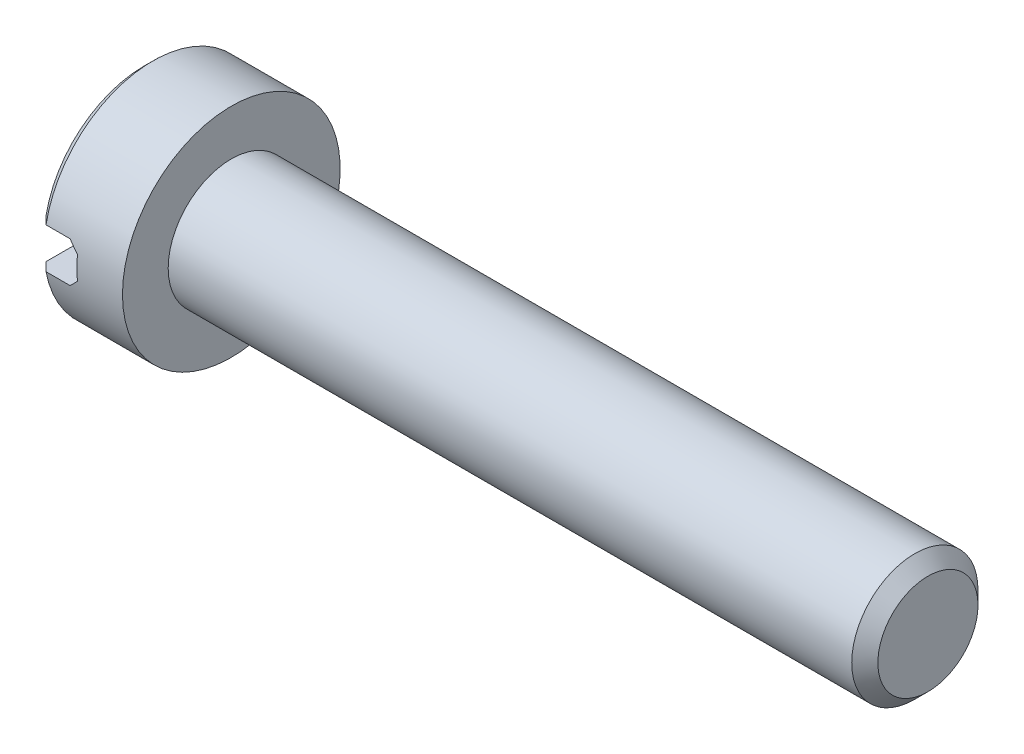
ISO-10303-21;
HEADER;
FILE_DESCRIPTION(('STEP AP214'),'2;1');
FILE_NAME('part.step','',(''),(''),'','','');
FILE_SCHEMA(('AUTOMOTIVE_DESIGN { 1 0 10303 214 1 1 1 1 }'));
ENDSEC;
DATA;
#1=APPLICATION_CONTEXT('core data for automotive mechanical design processes');
#2=APPLICATION_PROTOCOL_DEFINITION('international standard','automotive_design',2000,#1);
#3=PRODUCT_CONTEXT('',#1,'mechanical');
#4=PRODUCT('Part','Part','',(#3));
#5=PRODUCT_RELATED_PRODUCT_CATEGORY('part','',(#4));
#6=PRODUCT_DEFINITION_FORMATION('','',#4);
#7=PRODUCT_DEFINITION_CONTEXT('part definition',#1,'design');
#8=PRODUCT_DEFINITION('design','',#6,#7);
#9=PRODUCT_DEFINITION_SHAPE('','',#8);
#10=(LENGTH_UNIT() NAMED_UNIT(*) SI_UNIT(.MILLI.,.METRE.));
#11=(NAMED_UNIT(*) PLANE_ANGLE_UNIT() SI_UNIT($,.RADIAN.));
#12=(NAMED_UNIT(*) SI_UNIT($,.STERADIAN.) SOLID_ANGLE_UNIT());
#13=UNCERTAINTY_MEASURE_WITH_UNIT(LENGTH_MEASURE(1.E-05),#10,'distance_accuracy_value','');
#14=(GEOMETRIC_REPRESENTATION_CONTEXT(3) GLOBAL_UNCERTAINTY_ASSIGNED_CONTEXT((#13)) GLOBAL_UNIT_ASSIGNED_CONTEXT((#10,
#11,#12)) REPRESENTATION_CONTEXT('',''));
#15=CARTESIAN_POINT('',(0.,0.,0.));
#16=DIRECTION('',(0.,0.,1.));
#17=DIRECTION('',(1.,0.,0.));
#18=AXIS2_PLACEMENT_3D('',#15,#16,#17);
#19=CARTESIAN_POINT('',(2.,2.5,0.));
#20=DIRECTION('',(-1.,0.,0.));
#21=DIRECTION('',(0.,0.,1.));
#22=AXIS2_PLACEMENT_3D('',#19,#20,#21);
#23=PLANE('',#22);
#24=CARTESIAN_POINT('',(2.,0.,0.));
#25=DIRECTION('',(-1.,0.,0.));
#26=DIRECTION('',(0.,0.,1.));
#27=AXIS2_PLACEMENT_3D('',#24,#25,#26);
#28=CIRCLE('',#27,2.5);
#29=CARTESIAN_POINT('',(2.,0.,2.5));
#30=VERTEX_POINT('',#29);
#31=EDGE_CURVE('E198',#30,#30,#28,.T.);
#32=ORIENTED_EDGE('',*,*,#31,.F.);
#33=EDGE_LOOP('',(#32));
#34=FACE_BOUND('',#33,.T.);
#35=CARTESIAN_POINT('',(2.,0.,0.));
#36=DIRECTION('',(-1.,0.,0.));
#37=DIRECTION('',(0.,0.,1.));
#38=AXIS2_PLACEMENT_3D('',#35,#36,#37);
#39=CIRCLE('',#38,1.45);
#40=CARTESIAN_POINT('',(2.,0.,1.45));
#41=VERTEX_POINT('',#40);
#42=EDGE_CURVE('E150',#41,#41,#39,.F.);
#43=ORIENTED_EDGE('',*,*,#42,.F.);
#44=EDGE_LOOP('',(#43));
#45=FACE_BOUND('',#44,.T.);
#46=ADVANCED_FACE('F37',(#34,#45),#23,.F.);
#47=CARTESIAN_POINT('',(0.,0.,0.));
#48=DIRECTION('',(1.,0.,0.));
#49=DIRECTION('',(0.,0.,-1.));
#50=AXIS2_PLACEMENT_3D('',#47,#48,#49);
#51=PLANE('',#50);
#52=CARTESIAN_POINT('',(0.,0.,0.));
#53=DIRECTION('',(-1.,0.,0.));
#54=DIRECTION('',(0.,0.,1.));
#55=AXIS2_PLACEMENT_3D('',#52,#53,#54);
#56=CIRCLE('',#55,2.3);
#57=CARTESIAN_POINT('',(0.,0.465549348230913,2.25239068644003));
#58=VERTEX_POINT('',#57);
#59=CARTESIAN_POINT('',(0.,0.465549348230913,-2.25239068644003));
#60=VERTEX_POINT('',#59);
#61=EDGE_CURVE('E120',#58,#60,#56,.T.);
#62=ORIENTED_EDGE('',*,*,#61,.T.);
#63=DIRECTION('',(0.,0.,1.));
#64=VECTOR('',#63,1.);
#65=CARTESIAN_POINT('',(0.,0.465549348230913,-5.));
#66=LINE('',#65,#64);
#67=EDGE_CURVE('E112',#60,#58,#66,.T.);
#68=ORIENTED_EDGE('',*,*,#67,.T.);
#69=EDGE_LOOP('',(#62,#68));
#70=FACE_BOUND('',#69,.T.);
#71=ADVANCED_FACE('F166',(#70),#51,.F.);
#72=CARTESIAN_POINT('',(0.2,0.,0.));
#73=DIRECTION('',(1.,0.,0.));
#74=DIRECTION('',(0.,0.,-1.));
#75=AXIS2_PLACEMENT_3D('',#72,#73,#74);
#76=CONICAL_SURFACE('',#75,2.5,0.785398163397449);
#77=CARTESIAN_POINT('',(0.2,0.,0.));
#78=DIRECTION('',(-1.,0.,0.));
#79=DIRECTION('',(0.,0.,1.));
#80=AXIS2_PLACEMENT_3D('',#77,#78,#79);
#81=CIRCLE('',#80,2.5);
#82=CARTESIAN_POINT('',(0.2,0.465549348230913,2.45627030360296));
#83=VERTEX_POINT('',#82);
#84=CARTESIAN_POINT('',(0.2,0.465549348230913,-2.45627030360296));
#85=VERTEX_POINT('',#84);
#86=EDGE_CURVE('E121',#83,#85,#81,.T.);
#87=ORIENTED_EDGE('',*,*,#86,.T.);
#88=CARTESIAN_POINT('',(3.20259904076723,0.465549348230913,-5.48286968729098));
#89=CARTESIAN_POINT('',(3.00738145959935,0.465549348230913,-5.28694329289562));
#90=CARTESIAN_POINT('',(2.81219546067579,0.465549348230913,-5.09098538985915));
#91=CARTESIAN_POINT('',(2.42191937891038,0.465549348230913,-4.69895178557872));
#92=CARTESIAN_POINT('',(2.22682930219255,0.465549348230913,-4.50287607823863));
#93=CARTESIAN_POINT('',(1.83653240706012,0.465549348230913,-4.11030517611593));
#94=CARTESIAN_POINT('',(1.64132579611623,0.465549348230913,-3.9138097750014));
#95=CARTESIAN_POINT('',(1.25115924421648,0.465549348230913,-3.52059587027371));
#96=CARTESIAN_POINT('',(1.05619929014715,0.465549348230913,-3.32387737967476));
#97=CARTESIAN_POINT('',(0.678173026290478,0.465549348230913,-2.9416895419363));
#98=CARTESIAN_POINT('',(0.495084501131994,0.465549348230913,-2.7562421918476));
#99=CARTESIAN_POINT('',(0.220902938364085,0.465549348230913,-2.47759625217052));
#100=CARTESIAN_POINT('',(0.129576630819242,0.465549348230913,-2.38462728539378));
#101=CARTESIAN_POINT('',(-0.0528521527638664,0.465549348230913,-2.19847287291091));
#102=CARTESIAN_POINT('',(-0.143954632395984,0.465549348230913,-2.10528743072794));
#103=CARTESIAN_POINT('',(-0.325762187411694,0.465549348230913,-1.91867757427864));
#104=CARTESIAN_POINT('',(-0.416467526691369,0.465549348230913,-1.82525341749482));
#105=CARTESIAN_POINT('',(-0.597381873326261,0.465549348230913,-1.63791440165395));
#106=CARTESIAN_POINT('',(-0.687590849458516,0.465549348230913,-1.54399951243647));
#107=CARTESIAN_POINT('',(-0.867162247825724,0.465549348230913,-1.3554114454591));
#108=CARTESIAN_POINT('',(-0.956524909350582,0.465549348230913,-1.26073849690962));
#109=CARTESIAN_POINT('',(-1.08939468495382,0.465549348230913,-1.11764625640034));
#110=CARTESIAN_POINT('',(-1.1334867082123,0.465549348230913,-1.06977082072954));
#111=CARTESIAN_POINT('',(-1.2210969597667,0.465549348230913,-0.973498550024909));
#112=CARTESIAN_POINT('',(-1.26461520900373,0.465549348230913,-0.925101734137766));
#113=CARTESIAN_POINT('',(-1.3317610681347,0.465549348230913,-0.849065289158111));
#114=CARTESIAN_POINT('',(-1.35569012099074,0.465549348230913,-0.821692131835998));
#115=CARTESIAN_POINT('',(-1.40319102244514,0.465549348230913,-0.766632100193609));
#116=CARTESIAN_POINT('',(-1.42676283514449,0.465549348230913,-0.73894519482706));
#117=CARTESIAN_POINT('',(-1.47366376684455,0.465549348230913,-0.682886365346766));
#118=CARTESIAN_POINT('',(-1.49698800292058,0.465549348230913,-0.654510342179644));
#119=CARTESIAN_POINT('',(-1.54295549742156,0.465549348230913,-0.597221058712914));
#120=CARTESIAN_POINT('',(-1.56559892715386,0.465549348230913,-0.568307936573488));
#121=CARTESIAN_POINT('',(-1.61016736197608,0.465549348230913,-0.509419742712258));
#122=CARTESIAN_POINT('',(-1.63208156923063,0.465549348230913,-0.479436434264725));
#123=CARTESIAN_POINT('',(-1.67445976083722,0.465549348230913,-0.418389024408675));
#124=CARTESIAN_POINT('',(-1.69492180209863,0.465549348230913,-0.387323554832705));
#125=CARTESIAN_POINT('',(-1.73332185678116,0.465549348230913,-0.324061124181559));
#126=CARTESIAN_POINT('',(-1.75128287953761,0.465549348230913,-0.291878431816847));
#127=CARTESIAN_POINT('',(-1.78342369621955,0.465549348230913,-0.225717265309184));
#128=CARTESIAN_POINT('',(-1.79761500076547,0.465549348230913,-0.191744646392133));
#129=CARTESIAN_POINT('',(-1.81895609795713,0.465549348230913,-0.124795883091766));
#130=CARTESIAN_POINT('',(-1.8266128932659,0.465549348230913,-0.0919921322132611));
#131=CARTESIAN_POINT('',(-1.83488894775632,0.465549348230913,-0.0256267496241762));
#132=CARTESIAN_POINT('',(-1.83554895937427,0.465549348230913,0.00792935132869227));
#133=CARTESIAN_POINT('',(-1.82973306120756,0.465549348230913,0.0742464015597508));
#134=CARTESIAN_POINT('',(-1.82328333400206,0.465549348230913,0.107009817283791));
#135=CARTESIAN_POINT('',(-1.80956338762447,0.465549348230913,0.155027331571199));
#136=CARTESIAN_POINT('',(-1.80428518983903,0.465549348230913,0.170909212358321));
#137=CARTESIAN_POINT('',(-1.79261948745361,0.465549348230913,0.202260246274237));
#138=CARTESIAN_POINT('',(-1.78623214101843,0.465549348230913,0.217729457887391));
#139=CARTESIAN_POINT('',(-1.76761840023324,0.465549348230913,0.259328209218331));
#140=CARTESIAN_POINT('',(-1.7545143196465,0.465549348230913,0.285061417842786));
#141=CARTESIAN_POINT('',(-1.72651469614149,0.465549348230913,0.335544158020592));
#142=CARTESIAN_POINT('',(-1.71161720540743,0.465549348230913,0.360292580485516));
#143=CARTESIAN_POINT('',(-1.68054228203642,0.465549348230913,0.409079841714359));
#144=CARTESIAN_POINT('',(-1.66436078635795,0.465549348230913,0.433116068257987));
#145=CARTESIAN_POINT('',(-1.63111775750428,0.465549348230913,0.480575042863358));
#146=CARTESIAN_POINT('',(-1.61405601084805,0.465549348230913,0.503997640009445));
#147=CARTESIAN_POINT('',(-1.5616167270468,0.465549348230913,0.573971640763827));
#148=CARTESIAN_POINT('',(-1.52527399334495,0.465549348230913,0.619796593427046));
#149=CARTESIAN_POINT('',(-1.45124163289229,0.465549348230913,0.710149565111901));
#150=CARTESIAN_POINT('',(-1.41355526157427,0.465549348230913,0.7546802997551));
#151=CARTESIAN_POINT('',(-1.33810033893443,0.465549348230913,0.842013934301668));
#152=CARTESIAN_POINT('',(-1.30035092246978,0.465549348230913,0.884833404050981));
#153=CARTESIAN_POINT('',(-1.22427339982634,0.465549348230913,0.969954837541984));
#154=CARTESIAN_POINT('',(-1.18594527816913,0.465549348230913,1.01225678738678));
#155=CARTESIAN_POINT('',(-1.07035214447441,0.465549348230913,1.13862723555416));
#156=CARTESIAN_POINT('',(-0.992489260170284,0.465549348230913,1.22214795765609));
#157=CARTESIAN_POINT('',(-0.835814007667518,0.465549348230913,1.38847609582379));
#158=CARTESIAN_POINT('',(-0.757000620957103,0.465549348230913,1.47128254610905));
#159=CARTESIAN_POINT('',(-0.598849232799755,0.465549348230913,1.63637982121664));
#160=CARTESIAN_POINT('',(-0.519511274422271,0.465549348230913,1.71867068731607));
#161=CARTESIAN_POINT('',(-0.361217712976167,0.465549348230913,1.88216701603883));
#162=CARTESIAN_POINT('',(-0.282265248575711,0.465549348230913,1.9633755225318));
#163=CARTESIAN_POINT('',(-0.124123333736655,0.465549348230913,2.12556467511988));
#164=CARTESIAN_POINT('',(-0.044933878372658,0.465549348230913,2.20654531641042));
#165=CARTESIAN_POINT('',(0.192811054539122,0.465549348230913,2.44916767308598));
#166=CARTESIAN_POINT('',(0.351615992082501,0.465549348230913,2.61056482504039));
#167=CARTESIAN_POINT('',(0.732972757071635,0.465549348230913,2.99726131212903));
#168=CARTESIAN_POINT('',(0.955700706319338,0.465549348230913,3.22238674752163));
#169=CARTESIAN_POINT('',(1.401572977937,0.465549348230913,3.67230050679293));
#170=CARTESIAN_POINT('',(1.62471736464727,0.465549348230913,3.89708876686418));
#171=CARTESIAN_POINT('',(2.07358635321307,0.465549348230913,4.34881324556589));
#172=CARTESIAN_POINT('',(2.29931333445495,0.465549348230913,4.57574709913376));
#173=CARTESIAN_POINT('',(2.7508805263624,0.465549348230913,5.02942321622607));
#174=CARTESIAN_POINT('',(2.97672071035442,0.465549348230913,5.2561655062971));
#175=CARTESIAN_POINT('',(3.20259904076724,0.465549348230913,5.48286968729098));
#176=B_SPLINE_CURVE_WITH_KNOTS('',3,(#88,#89,#90,#91,#92,#93,#94,#95,#96,#97,#98,#99,#100,#101,
#102,#103,#104,#105,#106,#107,#108,#109,#110,#111,#112,#113,#114,#115,#116,#117,#118,#119,#120,
#121,#122,#123,#124,#125,#126,#127,#128,#129,#130,#131,#132,#133,#134,#135,#136,#137,#138,#139,
#140,#141,#142,#143,#144,#145,#146,#147,#148,#149,#150,#151,#152,#153,#154,#155,#156,#157,#158,
#159,#160,#161,#162,#163,#164,#165,#166,#167,#168,#169,#170,#171,#172,#173,#174,#175),
.UNSPECIFIED.,.F.,.F.,(4,2,2,2,2,2,2,2,2,2,2,2,2,2,2,2,2,2,2,2,2,2,2,2,2,2,2,2,2,2,2,2,2,2,2,2,
2,2,2,2,2,2,2,4),(0.,0.829743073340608,1.65953360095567,2.49046340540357,3.3213470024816,
4.10314469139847,4.49410926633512,4.88506752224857,5.27570632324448,5.66636942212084,
6.05691855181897,6.25217337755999,6.44742105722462,6.55649218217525,6.66557419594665,
6.77576205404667,6.88592195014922,6.99730763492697,7.10883965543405,7.21926609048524,
7.32935136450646,7.42981570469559,7.52969457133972,7.62920684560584,7.67938417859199,
7.72955436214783,7.81607261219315,7.90268569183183,7.9895847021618,8.07650488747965,
8.25190336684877,8.42690244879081,8.59814445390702,8.76939104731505,9.11193368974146,
9.45488345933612,9.79780541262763,10.1375912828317,10.4773842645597,11.1566564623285,
12.1067097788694,13.0569245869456,14.0171665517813,14.9772407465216),.UNSPECIFIED.);
#177=EDGE_CURVE('E60',#85,#60,#176,.T.);
#178=ORIENTED_EDGE('',*,*,#177,.T.);
#179=ORIENTED_EDGE('',*,*,#61,.F.);
#180=EDGE_CURVE('E192',#58,#83,#176,.T.);
#181=ORIENTED_EDGE('',*,*,#180,.T.);
#182=EDGE_LOOP('',(#87,#178,#179,#181));
#183=FACE_BOUND('',#182,.T.);
#184=ADVANCED_FACE('F172',(#183),#76,.T.);
#185=CARTESIAN_POINT('',(0.,-0.465549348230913,-2.25239068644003));
#186=VERTEX_POINT('',#185);
#187=CARTESIAN_POINT('',(0.,-0.465549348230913,2.25239068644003));
#188=VERTEX_POINT('',#187);
#189=EDGE_CURVE('E117',#186,#188,#56,.T.);
#190=ORIENTED_EDGE('',*,*,#189,.T.);
#191=DIRECTION('',(0.,0.,1.));
#192=VECTOR('',#191,1.);
#193=CARTESIAN_POINT('',(0.,-0.465549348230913,-5.));
#194=LINE('',#193,#192);
#195=EDGE_CURVE('E103',#186,#188,#194,.T.);
#196=ORIENTED_EDGE('',*,*,#195,.F.);
#197=EDGE_LOOP('',(#190,#196));
#198=FACE_BOUND('',#197,.T.);
#199=ADVANCED_FACE('F116',(#198),#51,.F.);
#200=CARTESIAN_POINT('',(0.2,-0.465549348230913,-2.45627030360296));
#201=VERTEX_POINT('',#200);
#202=CARTESIAN_POINT('',(0.2,-0.465549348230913,2.45627030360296));
#203=VERTEX_POINT('',#202);
#204=EDGE_CURVE('E125',#201,#203,#81,.T.);
#205=ORIENTED_EDGE('',*,*,#204,.T.);
#206=CARTESIAN_POINT('',(3.20259904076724,-0.465549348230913,5.48286968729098));
#207=CARTESIAN_POINT('',(3.00738145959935,-0.465549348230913,5.28694329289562));
#208=CARTESIAN_POINT('',(2.81219546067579,-0.465549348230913,5.09098538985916));
#209=CARTESIAN_POINT('',(2.42191937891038,-0.465549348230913,4.69895178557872));
#210=CARTESIAN_POINT('',(2.22682930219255,-0.465549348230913,4.50287607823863));
#211=CARTESIAN_POINT('',(1.83653240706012,-0.465549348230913,4.11030517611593));
#212=CARTESIAN_POINT('',(1.64132579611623,-0.465549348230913,3.9138097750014));
#213=CARTESIAN_POINT('',(1.25115924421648,-0.465549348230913,3.52059587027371));
#214=CARTESIAN_POINT('',(1.05619929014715,-0.465549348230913,3.32387737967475));
#215=CARTESIAN_POINT('',(0.678173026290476,-0.465549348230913,2.9416895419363));
#216=CARTESIAN_POINT('',(0.495084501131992,-0.465549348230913,2.75624219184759));
#217=CARTESIAN_POINT('',(0.220902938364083,-0.465549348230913,2.47759625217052));
#218=CARTESIAN_POINT('',(0.12957663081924,-0.465549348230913,2.38462728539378));
#219=CARTESIAN_POINT('',(-0.0528521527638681,-0.465549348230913,2.19847287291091));
#220=CARTESIAN_POINT('',(-0.143954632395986,-0.465549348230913,2.10528743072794));
#221=CARTESIAN_POINT('',(-0.325762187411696,-0.465549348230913,1.91867757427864));
#222=CARTESIAN_POINT('',(-0.41646752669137,-0.465549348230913,1.82525341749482));
#223=CARTESIAN_POINT('',(-0.597381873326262,-0.465549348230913,1.63791440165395));
#224=CARTESIAN_POINT('',(-0.687590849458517,-0.465549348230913,1.54399951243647));
#225=CARTESIAN_POINT('',(-0.867162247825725,-0.465549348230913,1.3554114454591));
#226=CARTESIAN_POINT('',(-0.956524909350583,-0.465549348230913,1.26073849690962));
#227=CARTESIAN_POINT('',(-1.08939468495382,-0.465549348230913,1.11764625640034));
#228=CARTESIAN_POINT('',(-1.1334867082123,-0.465549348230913,1.06977082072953));
#229=CARTESIAN_POINT('',(-1.2210969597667,-0.465549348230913,0.973498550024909));
#230=CARTESIAN_POINT('',(-1.26461520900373,-0.465549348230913,0.925101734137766));
#231=CARTESIAN_POINT('',(-1.33176106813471,-0.465549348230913,0.84906528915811));
#232=CARTESIAN_POINT('',(-1.35569012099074,-0.465549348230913,0.821692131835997));
#233=CARTESIAN_POINT('',(-1.40319102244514,-0.465549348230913,0.766632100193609));
#234=CARTESIAN_POINT('',(-1.42676283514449,-0.465549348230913,0.738945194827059));
#235=CARTESIAN_POINT('',(-1.47366376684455,-0.465549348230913,0.682886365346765));
#236=CARTESIAN_POINT('',(-1.49698800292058,-0.465549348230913,0.654510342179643));
#237=CARTESIAN_POINT('',(-1.54295549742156,-0.465549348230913,0.597221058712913));
#238=CARTESIAN_POINT('',(-1.56559892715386,-0.465549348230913,0.568307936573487));
#239=CARTESIAN_POINT('',(-1.61016736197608,-0.465549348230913,0.509419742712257));
#240=CARTESIAN_POINT('',(-1.63208156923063,-0.465549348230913,0.479436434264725));
#241=CARTESIAN_POINT('',(-1.67445976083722,-0.465549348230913,0.418389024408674));
#242=CARTESIAN_POINT('',(-1.69492180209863,-0.465549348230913,0.387323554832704));
#243=CARTESIAN_POINT('',(-1.73332185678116,-0.465549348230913,0.324061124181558));
#244=CARTESIAN_POINT('',(-1.75128287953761,-0.465549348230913,0.291878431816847));
#245=CARTESIAN_POINT('',(-1.78342369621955,-0.465549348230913,0.225717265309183));
#246=CARTESIAN_POINT('',(-1.79761500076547,-0.465549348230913,0.191744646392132));
#247=CARTESIAN_POINT('',(-1.81895609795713,-0.465549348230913,0.124795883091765));
#248=CARTESIAN_POINT('',(-1.8266128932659,-0.465549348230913,0.0919921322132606));
#249=CARTESIAN_POINT('',(-1.83488894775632,-0.465549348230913,0.0256267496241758));
#250=CARTESIAN_POINT('',(-1.83554895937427,-0.465549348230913,-0.00792935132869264));
#251=CARTESIAN_POINT('',(-1.82973306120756,-0.465549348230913,-0.0742464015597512));
#252=CARTESIAN_POINT('',(-1.82328333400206,-0.465549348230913,-0.107009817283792));
#253=CARTESIAN_POINT('',(-1.80956338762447,-0.465549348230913,-0.155027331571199));
#254=CARTESIAN_POINT('',(-1.80428518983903,-0.465549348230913,-0.170909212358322));
#255=CARTESIAN_POINT('',(-1.79261948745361,-0.465549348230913,-0.202260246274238));
#256=CARTESIAN_POINT('',(-1.78623214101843,-0.465549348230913,-0.217729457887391));
#257=CARTESIAN_POINT('',(-1.76761840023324,-0.465549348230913,-0.259328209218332));
#258=CARTESIAN_POINT('',(-1.7545143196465,-0.465549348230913,-0.285061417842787));
#259=CARTESIAN_POINT('',(-1.72651469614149,-0.465549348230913,-0.335544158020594));
#260=CARTESIAN_POINT('',(-1.71161720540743,-0.465549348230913,-0.360292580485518));
#261=CARTESIAN_POINT('',(-1.68054228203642,-0.465549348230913,-0.40907984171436));
#262=CARTESIAN_POINT('',(-1.66436078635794,-0.465549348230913,-0.433116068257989));
#263=CARTESIAN_POINT('',(-1.63111775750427,-0.465549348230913,-0.48057504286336));
#264=CARTESIAN_POINT('',(-1.61405601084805,-0.465549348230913,-0.503997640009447));
#265=CARTESIAN_POINT('',(-1.5616167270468,-0.465549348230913,-0.573971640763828));
#266=CARTESIAN_POINT('',(-1.52527399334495,-0.465549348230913,-0.619796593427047));
#267=CARTESIAN_POINT('',(-1.45124163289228,-0.465549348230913,-0.710149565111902));
#268=CARTESIAN_POINT('',(-1.41355526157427,-0.465549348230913,-0.754680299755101));
#269=CARTESIAN_POINT('',(-1.33810033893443,-0.465549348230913,-0.842013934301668));
#270=CARTESIAN_POINT('',(-1.30035092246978,-0.465549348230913,-0.88483340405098));
#271=CARTESIAN_POINT('',(-1.22427339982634,-0.465549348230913,-0.969954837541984));
#272=CARTESIAN_POINT('',(-1.18594527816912,-0.465549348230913,-1.01225678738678));
#273=CARTESIAN_POINT('',(-1.07035214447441,-0.465549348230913,-1.13862723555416));
#274=CARTESIAN_POINT('',(-0.992489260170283,-0.465549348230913,-1.2221479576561));
#275=CARTESIAN_POINT('',(-0.835814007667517,-0.465549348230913,-1.38847609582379));
#276=CARTESIAN_POINT('',(-0.757000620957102,-0.465549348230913,-1.47128254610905));
#277=CARTESIAN_POINT('',(-0.598849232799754,-0.465549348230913,-1.63637982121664));
#278=CARTESIAN_POINT('',(-0.51951127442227,-0.465549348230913,-1.71867068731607));
#279=CARTESIAN_POINT('',(-0.361217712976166,-0.465549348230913,-1.88216701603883));
#280=CARTESIAN_POINT('',(-0.282265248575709,-0.465549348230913,-1.9633755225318));
#281=CARTESIAN_POINT('',(-0.124123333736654,-0.465549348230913,-2.12556467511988));
#282=CARTESIAN_POINT('',(-0.0449338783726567,-0.465549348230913,-2.20654531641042));
#283=CARTESIAN_POINT('',(0.192811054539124,-0.465549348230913,-2.44916767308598));
#284=CARTESIAN_POINT('',(0.351615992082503,-0.465549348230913,-2.6105648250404));
#285=CARTESIAN_POINT('',(0.732972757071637,-0.465549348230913,-2.99726131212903));
#286=CARTESIAN_POINT('',(0.95570070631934,-0.465549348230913,-3.22238674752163));
#287=CARTESIAN_POINT('',(1.401572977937,-0.465549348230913,-3.67230050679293));
#288=CARTESIAN_POINT('',(1.62471736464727,-0.465549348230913,-3.89708876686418));
#289=CARTESIAN_POINT('',(2.07358635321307,-0.465549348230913,-4.34881324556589));
#290=CARTESIAN_POINT('',(2.29931333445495,-0.465549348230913,-4.57574709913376));
#291=CARTESIAN_POINT('',(2.75088052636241,-0.465549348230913,-5.02942321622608));
#292=CARTESIAN_POINT('',(2.97672071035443,-0.465549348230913,-5.2561655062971));
#293=CARTESIAN_POINT('',(3.20259904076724,-0.465549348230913,-5.48286968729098));
#294=B_SPLINE_CURVE_WITH_KNOTS('',3,(#206,#207,#208,#209,#210,#211,#212,#213,#214,#215,#216,
#217,#218,#219,#220,#221,#222,#223,#224,#225,#226,#227,#228,#229,#230,#231,#232,#233,#234,#235,
#236,#237,#238,#239,#240,#241,#242,#243,#244,#245,#246,#247,#248,#249,#250,#251,#252,#253,#254,
#255,#256,#257,#258,#259,#260,#261,#262,#263,#264,#265,#266,#267,#268,#269,#270,#271,#272,#273,
#274,#275,#276,#277,#278,#279,#280,#281,#282,#283,#284,#285,#286,#287,#288,#289,#290,#291,#292,
#293),.UNSPECIFIED.,.F.,.F.,(4,2,2,2,2,2,2,2,2,2,2,2,2,2,2,2,2,2,2,2,2,2,2,2,2,2,2,2,2,2,2,2,2,
2,2,2,2,2,2,2,2,2,2,4),(0.,0.82974307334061,1.65953360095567,2.49046340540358,3.32134700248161,
4.10314469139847,4.49410926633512,4.88506752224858,5.27570632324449,5.66636942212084,
6.05691855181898,6.25217337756,6.44742105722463,6.55649218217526,6.66557419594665,
6.77576205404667,6.88592195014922,6.99730763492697,7.10883965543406,7.21926609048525,
7.32935136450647,7.42981570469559,7.52969457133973,7.62920684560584,7.67938417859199,
7.72955436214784,7.81607261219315,7.90268569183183,7.98958470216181,8.07650488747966,
8.25190336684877,8.42690244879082,8.59814445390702,8.76939104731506,9.11193368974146,
9.45488345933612,9.79780541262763,10.1375912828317,10.4773842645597,11.1566564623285,
12.1067097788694,13.0569245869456,14.0171665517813,14.9772407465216),.UNSPECIFIED.);
#295=EDGE_CURVE('E111',#203,#188,#294,.T.);
#296=ORIENTED_EDGE('',*,*,#295,.T.);
#297=ORIENTED_EDGE('',*,*,#189,.F.);
#298=EDGE_CURVE('E100',#186,#201,#294,.T.);
#299=ORIENTED_EDGE('',*,*,#298,.T.);
#300=EDGE_LOOP('',(#205,#296,#297,#299));
#301=FACE_BOUND('',#300,.T.);
#302=ADVANCED_FACE('F119',(#301),#76,.T.);
#303=CARTESIAN_POINT('',(0.,0.,0.));
#304=DIRECTION('',(-1.,0.,0.));
#305=DIRECTION('',(0.,0.,1.));
#306=AXIS2_PLACEMENT_3D('',#303,#304,#305);
#307=CYLINDRICAL_SURFACE('',#306,2.5);
#308=ORIENTED_EDGE('',*,*,#86,.F.);
#309=DIRECTION('',(-1.,0.,0.));
#310=VECTOR('',#309,1.);
#311=CARTESIAN_POINT('',(0.,0.465549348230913,2.45627030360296));
#312=LINE('',#311,#310);
#313=CARTESIAN_POINT('',(0.753445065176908,0.465549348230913,2.45627030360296));
#314=VERTEX_POINT('',#313);
#315=EDGE_CURVE('E147',#83,#314,#312,.F.);
#316=ORIENTED_EDGE('',*,*,#315,.T.);
#317=CARTESIAN_POINT('',(1.21899441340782,0.,0.));
#318=DIRECTION('',(0.707106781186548,0.707106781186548,0.));
#319=DIRECTION('',(-0.707106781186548,0.707106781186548,0.));
#320=AXIS2_PLACEMENT_3D('',#317,#318,#319);
#321=ELLIPSE('',#320,3.53553390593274,2.5);
#322=CARTESIAN_POINT('',(0.953445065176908,0.265549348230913,2.48585670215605));
#323=VERTEX_POINT('',#322);
#324=EDGE_CURVE('E142',#314,#323,#321,.T.);
#325=ORIENTED_EDGE('',*,*,#324,.T.);
#326=CARTESIAN_POINT('',(0.953445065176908,0.,0.));
#327=DIRECTION('',(1.,0.,0.));
#328=DIRECTION('',(0.,0.,-1.));
#329=AXIS2_PLACEMENT_3D('',#326,#327,#328);
#330=CIRCLE('',#329,2.5);
#331=CARTESIAN_POINT('',(0.953445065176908,-0.265549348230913,2.48585670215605));
#332=VERTEX_POINT('',#331);
#333=EDGE_CURVE('E138',#323,#332,#330,.T.);
#334=ORIENTED_EDGE('',*,*,#333,.T.);
#335=CARTESIAN_POINT('',(1.21899441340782,0.,0.));
#336=DIRECTION('',(0.707106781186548,-0.707106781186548,0.));
#337=DIRECTION('',(-0.707106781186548,-0.707106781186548,0.));
#338=AXIS2_PLACEMENT_3D('',#335,#336,#337);
#339=ELLIPSE('',#338,3.53553390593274,2.5);
#340=CARTESIAN_POINT('',(0.753445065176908,-0.465549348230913,2.45627030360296));
#341=VERTEX_POINT('',#340);
#342=EDGE_CURVE('E134',#332,#341,#339,.T.);
#343=ORIENTED_EDGE('',*,*,#342,.T.);
#344=DIRECTION('',(-1.,0.,0.));
#345=VECTOR('',#344,1.);
#346=CARTESIAN_POINT('',(0.,-0.465549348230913,2.45627030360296));
#347=LINE('',#346,#345);
#348=EDGE_CURVE('E144',#341,#203,#347,.T.);
#349=ORIENTED_EDGE('',*,*,#348,.T.);
#350=ORIENTED_EDGE('',*,*,#204,.F.);
#351=DIRECTION('',(-1.,0.,0.));
#352=VECTOR('',#351,1.);
#353=CARTESIAN_POINT('',(0.,-0.465549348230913,-2.45627030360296));
#354=LINE('',#353,#352);
#355=CARTESIAN_POINT('',(0.753445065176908,-0.465549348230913,-2.45627030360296));
#356=VERTEX_POINT('',#355);
#357=EDGE_CURVE('E106',#201,#356,#354,.F.);
#358=ORIENTED_EDGE('',*,*,#357,.T.);
#359=CARTESIAN_POINT('',(0.953445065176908,-0.265549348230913,-2.48585670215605));
#360=VERTEX_POINT('',#359);
#361=EDGE_CURVE('E130',#356,#360,#339,.T.);
#362=ORIENTED_EDGE('',*,*,#361,.T.);
#363=CARTESIAN_POINT('',(0.953445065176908,0.265549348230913,-2.48585670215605));
#364=VERTEX_POINT('',#363);
#365=EDGE_CURVE('E133',#360,#364,#330,.T.);
#366=ORIENTED_EDGE('',*,*,#365,.T.);
#367=CARTESIAN_POINT('',(0.753445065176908,0.465549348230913,-2.45627030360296));
#368=VERTEX_POINT('',#367);
#369=EDGE_CURVE('E137',#364,#368,#321,.T.);
#370=ORIENTED_EDGE('',*,*,#369,.T.);
#371=DIRECTION('',(-1.,0.,0.));
#372=VECTOR('',#371,1.);
#373=CARTESIAN_POINT('',(0.,0.465549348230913,-2.45627030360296));
#374=LINE('',#373,#372);
#375=EDGE_CURVE('E141',#368,#85,#374,.T.);
#376=ORIENTED_EDGE('',*,*,#375,.T.);
#377=EDGE_LOOP('',(#308,#316,#325,#334,#343,#349,#350,#358,#362,#366,#370,#376));
#378=FACE_BOUND('',#377,.T.);
#379=ORIENTED_EDGE('',*,*,#31,.T.);
#380=EDGE_LOOP('',(#379));
#381=FACE_BOUND('',#380,.T.);
#382=ADVANCED_FACE('F180',(#378,#381),#307,.T.);
#383=CARTESIAN_POINT('',(0.,0.465549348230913,-5.));
#384=DIRECTION('',(0.,1.,0.));
#385=DIRECTION('',(0.,0.,1.));
#386=AXIS2_PLACEMENT_3D('',#383,#384,#385);
#387=PLANE('',#386);
#388=ORIENTED_EDGE('',*,*,#375,.F.);
#389=DIRECTION('',(0.,0.,1.));
#390=VECTOR('',#389,1.);
#391=CARTESIAN_POINT('',(0.753445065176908,0.465549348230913,-5.));
#392=LINE('',#391,#390);
#393=EDGE_CURVE('E228',#368,#314,#392,.T.);
#394=ORIENTED_EDGE('',*,*,#393,.T.);
#395=ORIENTED_EDGE('',*,*,#315,.F.);
#396=ORIENTED_EDGE('',*,*,#180,.F.);
#397=ORIENTED_EDGE('',*,*,#67,.F.);
#398=ORIENTED_EDGE('',*,*,#177,.F.);
#399=EDGE_LOOP('',(#388,#394,#395,#396,#397,#398));
#400=FACE_BOUND('',#399,.T.);
#401=ADVANCED_FACE('F183',(#400),#387,.F.);
#402=CARTESIAN_POINT('',(0.753445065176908,0.465549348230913,-5.));
#403=DIRECTION('',(0.707106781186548,0.707106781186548,0.));
#404=DIRECTION('',(-0.707106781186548,0.707106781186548,0.));
#405=AXIS2_PLACEMENT_3D('',#402,#403,#404);
#406=PLANE('',#405);
#407=ORIENTED_EDGE('',*,*,#393,.F.);
#408=ORIENTED_EDGE('',*,*,#369,.F.);
#409=DIRECTION('',(0.,0.,1.));
#410=VECTOR('',#409,1.);
#411=CARTESIAN_POINT('',(0.953445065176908,0.265549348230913,-5.));
#412=LINE('',#411,#410);
#413=EDGE_CURVE('E230',#364,#323,#412,.T.);
#414=ORIENTED_EDGE('',*,*,#413,.T.);
#415=ORIENTED_EDGE('',*,*,#324,.F.);
#416=EDGE_LOOP('',(#407,#408,#414,#415));
#417=FACE_BOUND('',#416,.T.);
#418=ADVANCED_FACE('F203',(#417),#406,.F.);
#419=CARTESIAN_POINT('',(0.953445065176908,0.265549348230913,-5.));
#420=DIRECTION('',(1.,0.,0.));
#421=DIRECTION('',(0.,0.,-1.));
#422=AXIS2_PLACEMENT_3D('',#419,#420,#421);
#423=PLANE('',#422);
#424=ORIENTED_EDGE('',*,*,#413,.F.);
#425=ORIENTED_EDGE('',*,*,#365,.F.);
#426=DIRECTION('',(0.,0.,1.));
#427=VECTOR('',#426,1.);
#428=CARTESIAN_POINT('',(0.953445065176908,-0.265549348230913,-5.));
#429=LINE('',#428,#427);
#430=EDGE_CURVE('E219',#360,#332,#429,.T.);
#431=ORIENTED_EDGE('',*,*,#430,.T.);
#432=ORIENTED_EDGE('',*,*,#333,.F.);
#433=EDGE_LOOP('',(#424,#425,#431,#432));
#434=FACE_BOUND('',#433,.T.);
#435=ADVANCED_FACE('F206',(#434),#423,.F.);
#436=CARTESIAN_POINT('',(0.753445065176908,-0.465549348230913,-5.));
#437=DIRECTION('',(0.707106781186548,-0.707106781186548,0.));
#438=DIRECTION('',(0.707106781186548,0.707106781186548,0.));
#439=AXIS2_PLACEMENT_3D('',#436,#437,#438);
#440=PLANE('',#439);
#441=DIRECTION('',(0.,0.,1.));
#442=VECTOR('',#441,1.);
#443=CARTESIAN_POINT('',(0.753445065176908,-0.465549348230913,-5.));
#444=LINE('',#443,#442);
#445=EDGE_CURVE('E52',#356,#341,#444,.T.);
#446=ORIENTED_EDGE('',*,*,#445,.T.);
#447=ORIENTED_EDGE('',*,*,#342,.F.);
#448=ORIENTED_EDGE('',*,*,#430,.F.);
#449=ORIENTED_EDGE('',*,*,#361,.F.);
#450=EDGE_LOOP('',(#446,#447,#448,#449));
#451=FACE_BOUND('',#450,.T.);
#452=ADVANCED_FACE('F209',(#451),#440,.F.);
#453=CARTESIAN_POINT('',(0.,-0.465549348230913,-5.));
#454=DIRECTION('',(0.,-1.,0.));
#455=DIRECTION('',(0.,0.,-1.));
#456=AXIS2_PLACEMENT_3D('',#453,#454,#455);
#457=PLANE('',#456);
#458=ORIENTED_EDGE('',*,*,#348,.F.);
#459=ORIENTED_EDGE('',*,*,#445,.F.);
#460=ORIENTED_EDGE('',*,*,#357,.F.);
#461=ORIENTED_EDGE('',*,*,#298,.F.);
#462=ORIENTED_EDGE('',*,*,#195,.T.);
#463=ORIENTED_EDGE('',*,*,#295,.F.);
#464=EDGE_LOOP('',(#458,#459,#460,#461,#462,#463));
#465=FACE_BOUND('',#464,.T.);
#466=ADVANCED_FACE('F102',(#465),#457,.F.);
#467=CARTESIAN_POINT('',(18.,0.,0.));
#468=DIRECTION('',(-1.,0.,0.));
#469=DIRECTION('',(0.,0.,1.));
#470=AXIS2_PLACEMENT_3D('',#467,#468,#469);
#471=CYLINDRICAL_SURFACE('',#470,1.45);
#472=CARTESIAN_POINT('',(17.7,0.,0.));
#473=DIRECTION('',(1.,0.,0.));
#474=DIRECTION('',(0.,0.,-1.));
#475=AXIS2_PLACEMENT_3D('',#472,#473,#474);
#476=CIRCLE('',#475,1.45);
#477=CARTESIAN_POINT('',(17.7,0.,-1.45));
#478=VERTEX_POINT('',#477);
#479=EDGE_CURVE('E11',#478,#478,#476,.F.);
#480=ORIENTED_EDGE('',*,*,#479,.T.);
#481=EDGE_LOOP('',(#480));
#482=FACE_BOUND('',#481,.T.);
#483=ORIENTED_EDGE('',*,*,#42,.T.);
#484=EDGE_LOOP('',(#483));
#485=FACE_BOUND('',#484,.T.);
#486=ADVANCED_FACE('F162',(#482,#485),#471,.T.);
#487=CARTESIAN_POINT('',(18.,0.,0.));
#488=DIRECTION('',(1.,0.,0.));
#489=DIRECTION('',(0.,0.,-1.));
#490=AXIS2_PLACEMENT_3D('',#487,#488,#489);
#491=PLANE('',#490);
#492=CARTESIAN_POINT('',(18.,0.,0.));
#493=DIRECTION('',(1.,0.,0.));
#494=DIRECTION('',(0.,0.,-1.));
#495=AXIS2_PLACEMENT_3D('',#492,#493,#494);
#496=CIRCLE('',#495,1.15);
#497=CARTESIAN_POINT('',(18.,0.,-1.15));
#498=VERTEX_POINT('',#497);
#499=EDGE_CURVE('E45',#498,#498,#496,.T.);
#500=ORIENTED_EDGE('',*,*,#499,.T.);
#501=EDGE_LOOP('',(#500));
#502=FACE_BOUND('',#501,.T.);
#503=ADVANCED_FACE('F155',(#502),#491,.T.);
#504=CARTESIAN_POINT('',(18.,0.,0.));
#505=DIRECTION('',(-1.,0.,0.));
#506=DIRECTION('',(0.,0.,1.));
#507=AXIS2_PLACEMENT_3D('',#504,#505,#506);
#508=CONICAL_SURFACE('',#507,1.15,0.78539816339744);
#509=ORIENTED_EDGE('',*,*,#479,.F.);
#510=EDGE_LOOP('',(#509));
#511=FACE_BOUND('',#510,.T.);
#512=ORIENTED_EDGE('',*,*,#499,.F.);
#513=EDGE_LOOP('',(#512));
#514=FACE_BOUND('',#513,.T.);
#515=ADVANCED_FACE('F39',(#511,#514),#508,.T.);
#516=CLOSED_SHELL('',(#46,#71,#184,#199,#302,#382,#401,#418,#435,#452,#466,#486,#503,#515));
#517=MANIFOLD_SOLID_BREP('B2',#516);
#518=ADVANCED_BREP_SHAPE_REPRESENTATION('',(#18,#517),#14);
#519=SHAPE_DEFINITION_REPRESENTATION(#9,#518);
ENDSEC;
END-ISO-10303-21;
